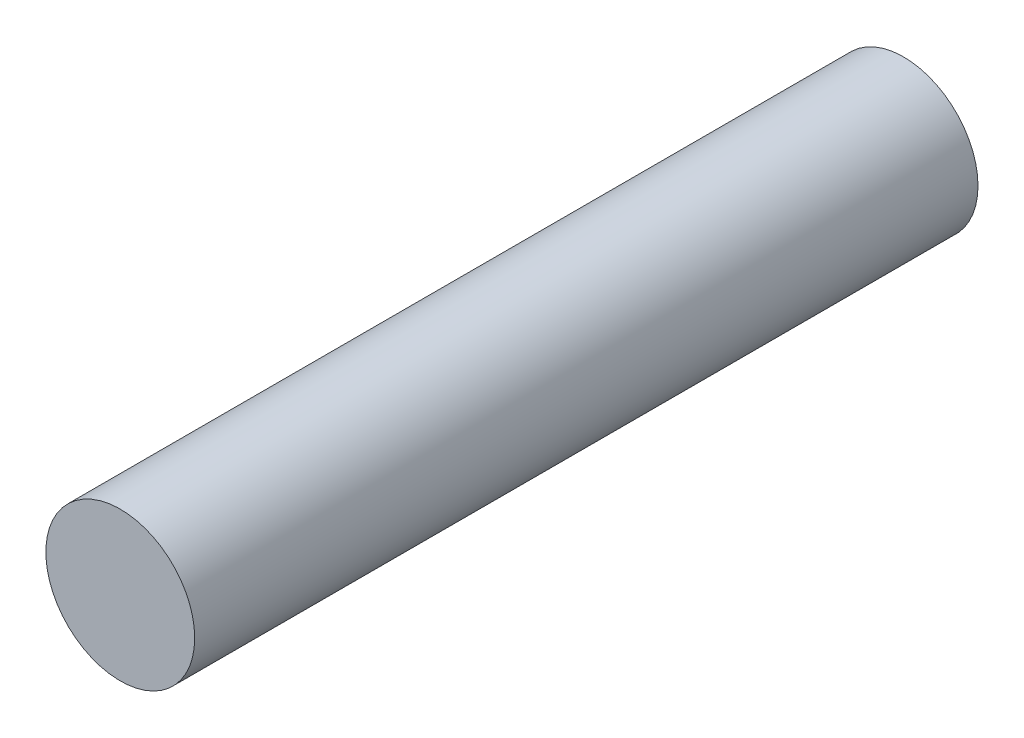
from build123d import *

# Parameters (mm, degrees)
ESQUISSE1_R      = 0.95
EXTRUSION1_DEPTH = 10


with BuildPart() as part:
    # Esquisse1 → Extrusion1 (new body)
    with BuildSketch(Plane.XY):
        Circle(ESQUISSE1_R)
    extrude(amount=EXTRUSION1_DEPTH)


solid = part.part
